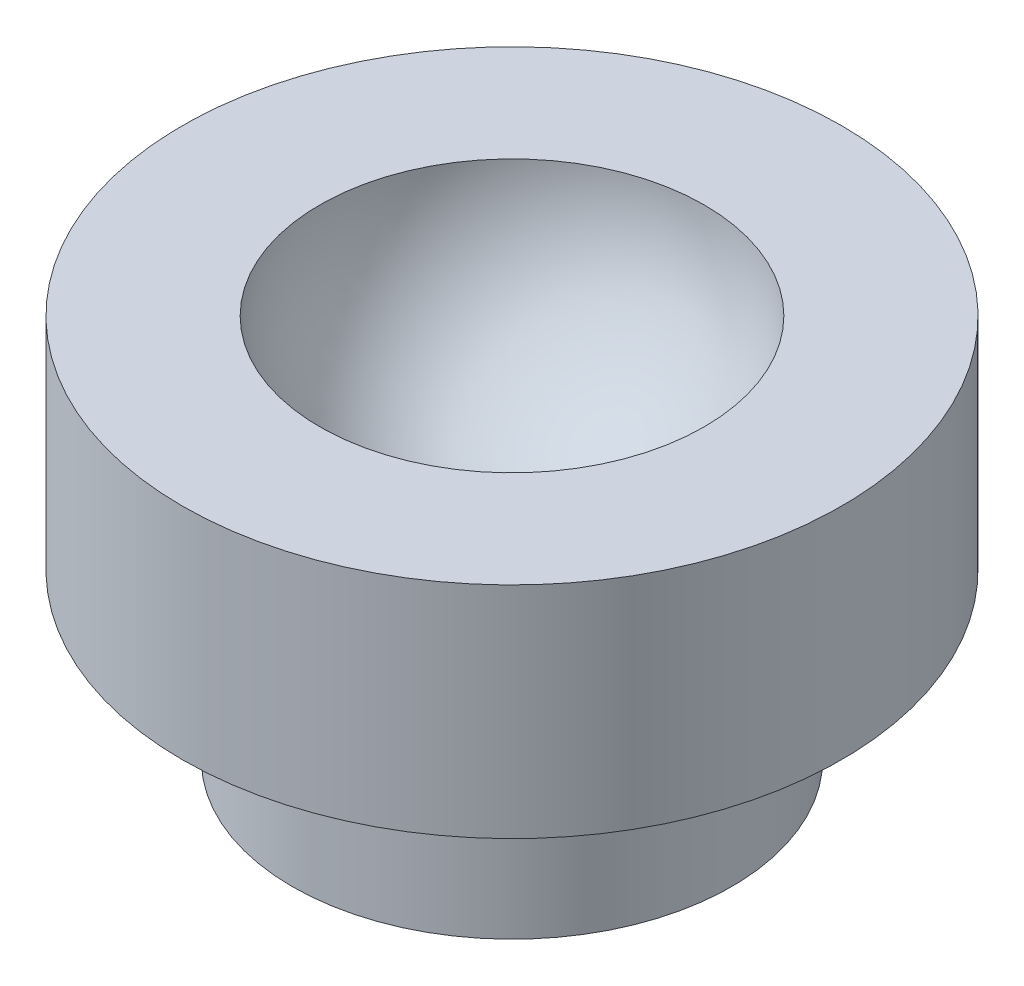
ISO-10303-21;
HEADER;
FILE_DESCRIPTION(('STEP AP214'),'2;1');
FILE_NAME('part.step','',(''),(''),'','','');
FILE_SCHEMA(('AUTOMOTIVE_DESIGN { 1 0 10303 214 1 1 1 1 }'));
ENDSEC;
DATA;
#1=APPLICATION_CONTEXT('core data for automotive mechanical design processes');
#2=APPLICATION_PROTOCOL_DEFINITION('international standard','automotive_design',2000,#1);
#3=PRODUCT_CONTEXT('',#1,'mechanical');
#4=PRODUCT('Part','Part','',(#3));
#5=PRODUCT_RELATED_PRODUCT_CATEGORY('part','',(#4));
#6=PRODUCT_DEFINITION_FORMATION('','',#4);
#7=PRODUCT_DEFINITION_CONTEXT('part definition',#1,'design');
#8=PRODUCT_DEFINITION('design','',#6,#7);
#9=PRODUCT_DEFINITION_SHAPE('','',#8);
#10=(LENGTH_UNIT() NAMED_UNIT(*) SI_UNIT(.MILLI.,.METRE.));
#11=(NAMED_UNIT(*) PLANE_ANGLE_UNIT() SI_UNIT($,.RADIAN.));
#12=(NAMED_UNIT(*) SI_UNIT($,.STERADIAN.) SOLID_ANGLE_UNIT());
#13=UNCERTAINTY_MEASURE_WITH_UNIT(LENGTH_MEASURE(1.E-05),#10,'distance_accuracy_value','');
#14=(GEOMETRIC_REPRESENTATION_CONTEXT(3) GLOBAL_UNCERTAINTY_ASSIGNED_CONTEXT((#13)) GLOBAL_UNIT_ASSIGNED_CONTEXT((#10,
#11,#12)) REPRESENTATION_CONTEXT('',''));
#15=CARTESIAN_POINT('',(0.,0.,0.));
#16=DIRECTION('',(0.,0.,1.));
#17=DIRECTION('',(1.,0.,0.));
#18=AXIS2_PLACEMENT_3D('',#15,#16,#17);
#19=CARTESIAN_POINT('',(0.,0.,0.));
#20=DIRECTION('',(0.,-1.,0.));
#21=DIRECTION('',(0.,0.,-1.));
#22=AXIS2_PLACEMENT_3D('',#19,#20,#21);
#23=PLANE('',#22);
#24=CARTESIAN_POINT('',(0.,0.,0.));
#25=DIRECTION('',(0.,-1.,0.));
#26=DIRECTION('',(0.,0.,-1.));
#27=AXIS2_PLACEMENT_3D('',#24,#25,#26);
#28=CIRCLE('',#27,40.);
#29=CARTESIAN_POINT('',(0.,0.,-40.));
#30=VERTEX_POINT('',#29);
#31=EDGE_CURVE('E10',#30,#30,#28,.T.);
#32=ORIENTED_EDGE('',*,*,#31,.T.);
#33=EDGE_LOOP('',(#32));
#34=FACE_BOUND('',#33,.T.);
#35=ADVANCED_FACE('F31',(#34),#23,.T.);
#36=CARTESIAN_POINT('',(0.,-25.1280260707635,0.));
#37=DIRECTION('',(0.,-1.,0.));
#38=DIRECTION('',(0.,0.,-1.));
#39=AXIS2_PLACEMENT_3D('',#36,#37,#38);
#40=CYLINDRICAL_SURFACE('',#39,40.);
#41=CARTESIAN_POINT('',(0.,30.,0.));
#42=DIRECTION('',(0.,-1.,0.));
#43=DIRECTION('',(0.,0.,-1.));
#44=AXIS2_PLACEMENT_3D('',#41,#42,#43);
#45=CIRCLE('',#44,40.);
#46=CARTESIAN_POINT('',(0.,30.,-40.));
#47=VERTEX_POINT('',#46);
#48=EDGE_CURVE('E37',#47,#47,#45,.T.);
#49=ORIENTED_EDGE('',*,*,#48,.T.);
#50=EDGE_LOOP('',(#49));
#51=FACE_BOUND('',#50,.T.);
#52=ORIENTED_EDGE('',*,*,#31,.F.);
#53=EDGE_LOOP('',(#52));
#54=FACE_BOUND('',#53,.T.);
#55=ADVANCED_FACE('F66',(#51,#54),#40,.T.);
#56=CARTESIAN_POINT('',(40.,30.,0.));
#57=DIRECTION('',(0.,-1.,0.));
#58=DIRECTION('',(0.,0.,-1.));
#59=AXIS2_PLACEMENT_3D('',#56,#57,#58);
#60=PLANE('',#59);
#61=CARTESIAN_POINT('',(0.,30.,0.));
#62=DIRECTION('',(0.,-1.,0.));
#63=DIRECTION('',(0.,0.,-1.));
#64=AXIS2_PLACEMENT_3D('',#61,#62,#63);
#65=CIRCLE('',#64,60.);
#66=CARTESIAN_POINT('',(0.,30.,-60.));
#67=VERTEX_POINT('',#66);
#68=EDGE_CURVE('E41',#67,#67,#65,.T.);
#69=ORIENTED_EDGE('',*,*,#68,.T.);
#70=EDGE_LOOP('',(#69));
#71=FACE_BOUND('',#70,.T.);
#72=ORIENTED_EDGE('',*,*,#48,.F.);
#73=EDGE_LOOP('',(#72));
#74=FACE_BOUND('',#73,.T.);
#75=ADVANCED_FACE('F70',(#71,#74),#60,.T.);
#76=CARTESIAN_POINT('',(0.,-25.1280260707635,0.));
#77=DIRECTION('',(0.,-1.,0.));
#78=DIRECTION('',(0.,0.,-1.));
#79=AXIS2_PLACEMENT_3D('',#76,#77,#78);
#80=CYLINDRICAL_SURFACE('',#79,60.);
#81=CARTESIAN_POINT('',(0.,70.,0.));
#82=DIRECTION('',(0.,-1.,0.));
#83=DIRECTION('',(0.,0.,-1.));
#84=AXIS2_PLACEMENT_3D('',#81,#82,#83);
#85=CIRCLE('',#84,60.);
#86=CARTESIAN_POINT('',(0.,70.,-60.));
#87=VERTEX_POINT('',#86);
#88=EDGE_CURVE('E45',#87,#87,#85,.T.);
#89=ORIENTED_EDGE('',*,*,#88,.T.);
#90=EDGE_LOOP('',(#89));
#91=FACE_BOUND('',#90,.T.);
#92=ORIENTED_EDGE('',*,*,#68,.F.);
#93=EDGE_LOOP('',(#92));
#94=FACE_BOUND('',#93,.T.);
#95=ADVANCED_FACE('F63',(#91,#94),#80,.T.);
#96=CARTESIAN_POINT('',(60.,70.,0.));
#97=DIRECTION('',(0.,1.,0.));
#98=DIRECTION('',(0.,0.,1.));
#99=AXIS2_PLACEMENT_3D('',#96,#97,#98);
#100=PLANE('',#99);
#101=CARTESIAN_POINT('',(0.,70.,0.));
#102=DIRECTION('',(0.,-1.,0.));
#103=DIRECTION('',(0.,0.,-1.));
#104=AXIS2_PLACEMENT_3D('',#101,#102,#103);
#105=CIRCLE('',#104,34.999875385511);
#106=CARTESIAN_POINT('',(0.,70.,-34.999875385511));
#107=VERTEX_POINT('',#106);
#108=EDGE_CURVE('E50',#107,#107,#105,.T.);
#109=ORIENTED_EDGE('',*,*,#108,.T.);
#110=EDGE_LOOP('',(#109));
#111=FACE_BOUND('',#110,.T.);
#112=ORIENTED_EDGE('',*,*,#88,.F.);
#113=EDGE_LOOP('',(#112));
#114=FACE_BOUND('',#113,.T.);
#115=ADVANCED_FACE('F54',(#111,#114),#100,.T.);
#116=CARTESIAN_POINT('',(0.,70.0933969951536,0.));
#117=DIRECTION('',(0.,-1.,0.));
#118=DIRECTION('',(1.,0.,0.));
#119=AXIS2_PLACEMENT_3D('',#116,#117,#118);
#120=SPHERICAL_SURFACE('',#119,35.);
#121=ORIENTED_EDGE('',*,*,#108,.F.);
#122=EDGE_LOOP('',(#121));
#123=FACE_BOUND('',#122,.T.);
#124=ADVANCED_FACE('F57',(#123),#120,.F.);
#125=CLOSED_SHELL('',(#35,#55,#75,#95,#115,#124));
#126=MANIFOLD_SOLID_BREP('B2',#125);
#127=ADVANCED_BREP_SHAPE_REPRESENTATION('',(#18,#126),#14);
#128=SHAPE_DEFINITION_REPRESENTATION(#9,#127);
ENDSEC;
END-ISO-10303-21;
